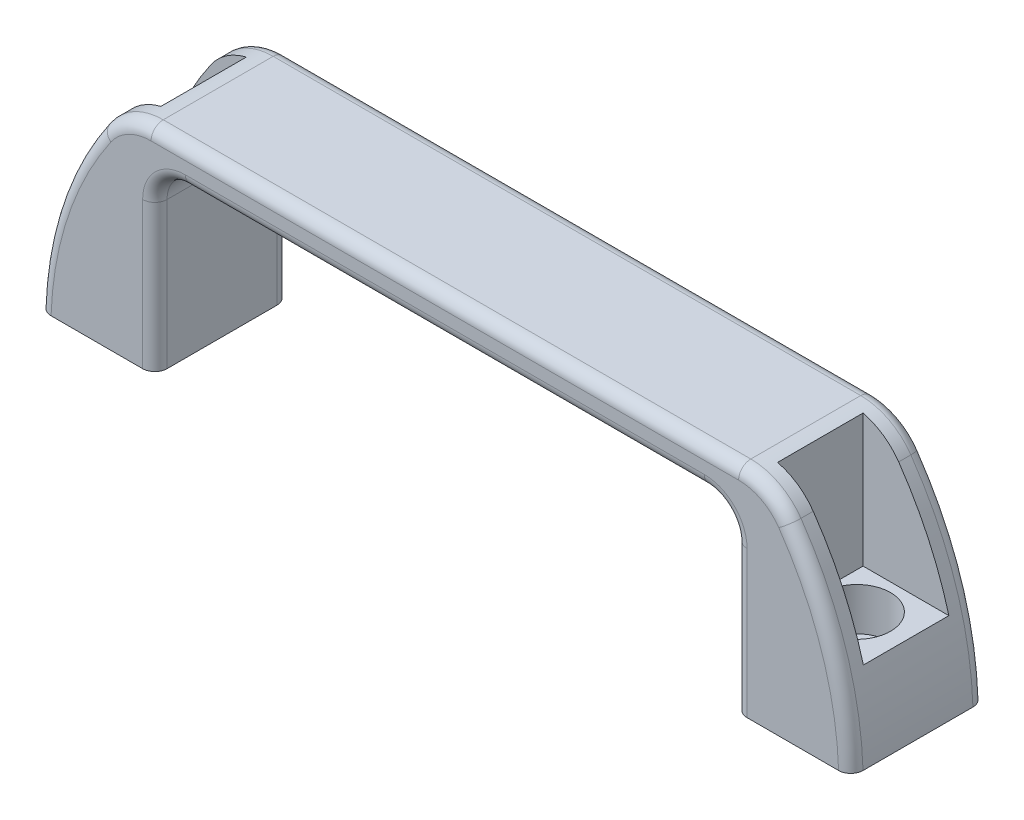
from build123d import *

# Parameters (mm, degrees)
EXTRUDE_1_DEPTH           = 11
SKETCH_2_W                = 16.081343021
SKETCH_2_H                = 23.765978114
SKETCH_2_W_2              = 17.435428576
CUT_EXTRUDE_2_DEPTH       = 7
HOLE_WIZARD_1_D           = 6.6
HOLE_WIZARD_1_CBORE_D     = 11
HOLE_WIZARD_1_CBORE_DEPTH = 7
FILLET_1_R                = 2


with BuildPart() as part:
    # Sketch 1 → Extrude 1 (new, symmetric)
    with BuildSketch(Plane.XY):
        with BuildLine():
            Line((408.172192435, 64.792759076), (427.172192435, 64.792759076))
            Line((427.172192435, 64.792759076), (427.172192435, 88.792759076))
            ThreePointArc((427.172192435, 88.792759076), (428.636658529, 92.328292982), (432.172192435, 93.792759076))
            Line((432.172192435, 93.792759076), (517.172192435, 93.792759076))
            ThreePointArc((517.172192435, 93.792759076), (520.707726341, 92.328292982), (522.172192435, 88.792759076))
            Line((522.172192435, 88.792759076), (522.172192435, 64.792759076))
            Line((522.172192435, 64.792759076), (541.172192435, 64.792759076))
            ThreePointArc((541.172192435, 64.792759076), (538.304998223, 80.874524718), (531.009723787, 95.490370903))
            ThreePointArc((531.009723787, 95.490370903), (527.429717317, 98.652107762), (522.791620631, 99.792759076))
            Line((522.791620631, 99.792759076), (426.552764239, 99.792759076))
            ThreePointArc((426.552764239, 99.792759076), (421.914667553, 98.652107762), (418.334661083, 95.490370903))
            ThreePointArc((418.334661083, 95.490370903), (411.039386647, 80.874524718), (408.172192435, 64.792759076))
        make_face()
    extrude(amount=EXTRUDE_1_DEPTH, both=True)

    # Sketch 2 → Cut-Extrude 2 (cut, symmetric)
    with BuildSketch(Plane.XY):
        with Locations((533.212863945, 89.675748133)):
            Rectangle(SKETCH_2_W, SKETCH_2_H)
        with Locations((415.454478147, 89.675748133)):
            Rectangle(SKETCH_2_W_2, SKETCH_2_H)
    extrude(amount=CUT_EXTRUDE_2_DEPTH, both=True, mode=Mode.SUBTRACT)

    # Hole Wizard 1 (through all)
    with Locations(Plane(origin=(531.172192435, 77.792759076, 0), x_dir=(0, 0, 1), z_dir=(0, 1, 0))):
        with Locations((0, 0), (0, -113)):
            CounterBoreHole(HOLE_WIZARD_1_D / 2, HOLE_WIZARD_1_CBORE_D / 2, HOLE_WIZARD_1_CBORE_DEPTH)

    # Fillet 1
    fillet_1_edges = [part.edges().sort_by_distance(p)[0] for p in [
        (474.672192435, 99.792759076, -11),
        (527.429717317, 98.652107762, -11),
        (538.304998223, 80.874524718, -11),
        (522.172192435, 76.792759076, -11),
        (520.707726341, 92.328292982, -11),
        (427.172192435, 76.792759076, 11),
        (474.672192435, 93.792759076, -11),
        (428.636658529, 92.328292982, -11),
        (427.172192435, 76.792759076, -11),
        (411.039386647, 80.874524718, -11),
        (421.914667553, 98.652107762, -11),
        (428.636658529, 92.328292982, 11),
        (474.672192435, 93.792759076, 11),
        (520.707726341, 92.328292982, 11),
        (522.172192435, 76.792759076, 11),
        (538.304998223, 80.874524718, 11),
        (527.429717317, 98.652107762, 11),
        (474.672192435, 99.792759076, 11),
        (421.914667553, 98.652107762, 11),
        (411.039386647, 80.874524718, 11),
    ]]
    fillet(fillet_1_edges, radius=FILLET_1_R)


solid = part.part
